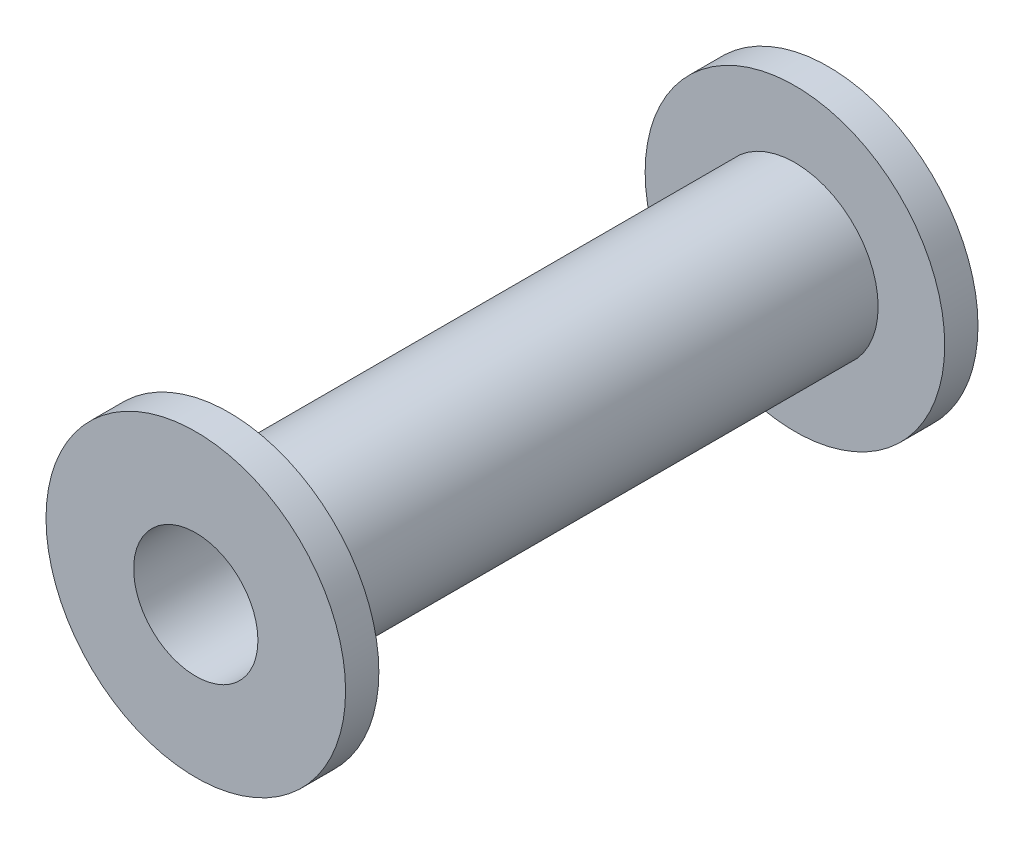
from build123d import *

# Parameters (mm, degrees)
ESBO_O1_R                = 13.5
ESBO_O1_R_2              = 5.6
RESSALTO_EXTRUS_O1_DEPTH = 3
ESBO_O2_R                = 7.5
ESBO_O2_R_2              = 5.6
RESSALTO_EXTRUS_O2_DEPTH = 51
ESBO_O3_R                = 13.5
ESBO_O3_R_2              = 5.6
RESSALTO_EXTRUS_O3_DEPTH = 3


with BuildPart() as part:
    # Esbo_o1 → Ressalto-extrus_o1 (new body)
    with BuildSketch(Plane.XY):
        Circle(ESBO_O1_R)
        Circle(ESBO_O1_R_2, mode=Mode.SUBTRACT)
    extrude(amount=RESSALTO_EXTRUS_O1_DEPTH)

    # Esbo_o2 → Ressalto-extrus_o2 (add)
    with BuildSketch(Plane.XY.offset(3)):
        Circle(ESBO_O2_R)
        Circle(ESBO_O2_R_2, mode=Mode.SUBTRACT)
    extrude(amount=RESSALTO_EXTRUS_O2_DEPTH)

    # Esbo_o3 → Ressalto-extrus_o3 (add)
    with BuildSketch(Plane.XY.offset(54)):
        Circle(ESBO_O3_R)
        Circle(ESBO_O3_R_2, mode=Mode.SUBTRACT)
    extrude(amount=RESSALTO_EXTRUS_O3_DEPTH)


solid = part.part
